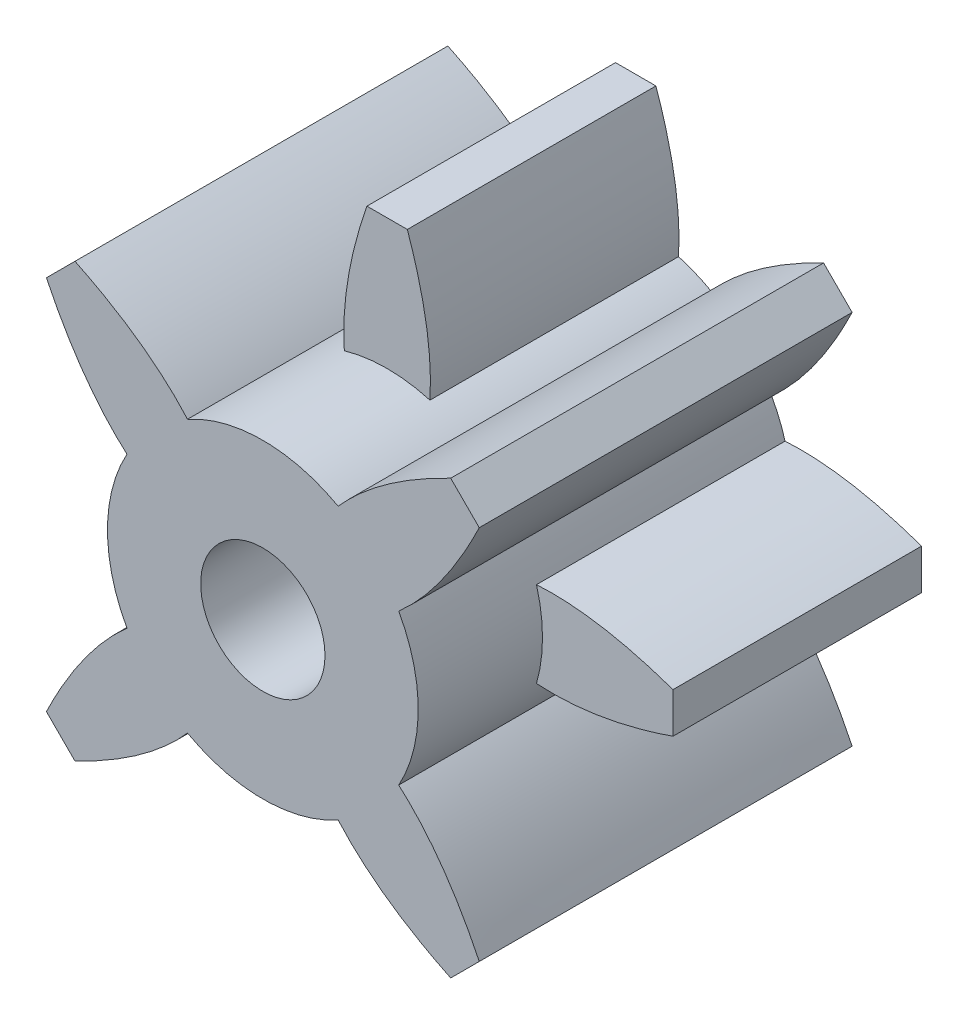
ISO-10303-21;
HEADER;
FILE_DESCRIPTION(('STEP AP214'),'2;1');
FILE_NAME('part.step','',(''),(''),'','','');
FILE_SCHEMA(('AUTOMOTIVE_DESIGN { 1 0 10303 214 1 1 1 1 }'));
ENDSEC;
DATA;
#1=APPLICATION_CONTEXT('core data for automotive mechanical design processes');
#2=APPLICATION_PROTOCOL_DEFINITION('international standard','automotive_design',2000,#1);
#3=PRODUCT_CONTEXT('',#1,'mechanical');
#4=PRODUCT('Part','Part','',(#3));
#5=PRODUCT_RELATED_PRODUCT_CATEGORY('part','',(#4));
#6=PRODUCT_DEFINITION_FORMATION('','',#4);
#7=PRODUCT_DEFINITION_CONTEXT('part definition',#1,'design');
#8=PRODUCT_DEFINITION('design','',#6,#7);
#9=PRODUCT_DEFINITION_SHAPE('','',#8);
#10=(LENGTH_UNIT() NAMED_UNIT(*) SI_UNIT(.MILLI.,.METRE.));
#11=(NAMED_UNIT(*) PLANE_ANGLE_UNIT() SI_UNIT($,.RADIAN.));
#12=(NAMED_UNIT(*) SI_UNIT($,.STERADIAN.) SOLID_ANGLE_UNIT());
#13=UNCERTAINTY_MEASURE_WITH_UNIT(LENGTH_MEASURE(1.E-05),#10,'distance_accuracy_value','');
#14=(GEOMETRIC_REPRESENTATION_CONTEXT(3) GLOBAL_UNCERTAINTY_ASSIGNED_CONTEXT((#13)) GLOBAL_UNIT_ASSIGNED_CONTEXT((#10,
#11,#12)) REPRESENTATION_CONTEXT('',''));
#15=CARTESIAN_POINT('',(0.,0.,0.));
#16=DIRECTION('',(0.,0.,1.));
#17=DIRECTION('',(1.,0.,0.));
#18=AXIS2_PLACEMENT_3D('',#15,#16,#17);
#19=CARTESIAN_POINT('',(0.,63.,-65.3553390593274));
#20=DIRECTION('',(0.,0.,1.));
#21=DIRECTION('',(1.,0.,0.));
#22=AXIS2_PLACEMENT_3D('',#19,#20,#21);
#23=CYLINDRICAL_SURFACE('',#22,12.5);
#24=DIRECTION('',(0.,0.,1.));
#25=VECTOR('',#24,1.);
#26=CARTESIAN_POINT('',(12.0157712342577,66.4454669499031,-30.));
#27=LINE('',#26,#25);
#28=CARTESIAN_POINT('',(12.0157712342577,66.4454669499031,-30.));
#29=VERTEX_POINT('',#28);
#30=CARTESIAN_POINT('',(12.0157712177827,66.4454669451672,-10.));
#31=VERTEX_POINT('',#30);
#32=EDGE_CURVE('E983',#29,#31,#27,.T.);
#33=ORIENTED_EDGE('',*,*,#32,.F.);
#34=CARTESIAN_POINT('',(0.,63.,-30.));
#35=DIRECTION('',(0.,0.,1.));
#36=DIRECTION('',(1.,0.,0.));
#37=AXIS2_PLACEMENT_3D('',#34,#35,#36);
#38=CIRCLE('',#37,12.5);
#39=CARTESIAN_POINT('',(10.9327463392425,69.0601202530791,-30.));
#40=VERTEX_POINT('',#39);
#41=EDGE_CURVE('E380',#40,#29,#38,.F.);
#42=ORIENTED_EDGE('',*,*,#41,.F.);
#43=DIRECTION('',(0.,0.,1.));
#44=VECTOR('',#43,1.);
#45=CARTESIAN_POINT('',(10.9327463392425,69.0601202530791,-30.));
#46=LINE('',#45,#44);
#47=CARTESIAN_POINT('',(10.9327463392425,69.0601202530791,0.));
#48=VERTEX_POINT('',#47);
#49=EDGE_CURVE('E546',#40,#48,#46,.T.);
#50=ORIENTED_EDGE('',*,*,#49,.T.);
#51=CARTESIAN_POINT('',(0.,63.,0.));
#52=DIRECTION('',(0.,0.,1.));
#53=DIRECTION('',(1.,0.,0.));
#54=AXIS2_PLACEMENT_3D('',#51,#52,#53);
#55=CIRCLE('',#54,12.5);
#56=CARTESIAN_POINT('',(10.9327463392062,56.9398797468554,0.));
#57=VERTEX_POINT('',#56);
#58=EDGE_CURVE('E366',#57,#48,#55,.T.);
#59=ORIENTED_EDGE('',*,*,#58,.F.);
#60=DIRECTION('',(0.,0.,1.));
#61=VECTOR('',#60,1.);
#62=CARTESIAN_POINT('',(10.9327463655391,56.9398797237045,-30.));
#63=LINE('',#62,#61);
#64=CARTESIAN_POINT('',(10.9327463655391,56.9398797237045,-30.));
#65=VERTEX_POINT('',#64);
#66=EDGE_CURVE('E1034',#65,#57,#63,.T.);
#67=ORIENTED_EDGE('',*,*,#66,.F.);
#68=CARTESIAN_POINT('',(12.0157711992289,59.5545330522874,-30.));
#69=VERTEX_POINT('',#68);
#70=EDGE_CURVE('E375',#69,#65,#38,.F.);
#71=ORIENTED_EDGE('',*,*,#70,.F.);
#72=DIRECTION('',(0.,0.,1.));
#73=VECTOR('',#72,1.);
#74=CARTESIAN_POINT('',(12.0157711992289,59.5545330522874,-30.));
#75=LINE('',#74,#73);
#76=CARTESIAN_POINT('',(12.0157712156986,59.5545330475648,-10.));
#77=VERTEX_POINT('',#76);
#78=EDGE_CURVE('E550',#69,#77,#75,.T.);
#79=ORIENTED_EDGE('',*,*,#78,.T.);
#80=CARTESIAN_POINT('',(0.,63.,-10.));
#81=DIRECTION('',(0.,0.,-1.));
#82=DIRECTION('',(1.,0.,0.));
#83=AXIS2_PLACEMENT_3D('',#80,#81,#82);
#84=CIRCLE('',#83,12.5000000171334);
#85=EDGE_CURVE('E254',#31,#77,#84,.T.);
#86=ORIENTED_EDGE('',*,*,#85,.F.);
#87=EDGE_LOOP('',(#33,#42,#50,#59,#67,#71,#79,#86));
#88=FACE_BOUND('',#87,.T.);
#89=ADVANCED_FACE('F33',(#88),#23,.T.);
#90=DIRECTION('',(0.,0.,1.));
#91=VECTOR('',#90,1.);
#92=CARTESIAN_POINT('',(-3.44546694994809,75.0157712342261,-30.));
#93=LINE('',#92,#91);
#94=CARTESIAN_POINT('',(-3.44546694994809,75.0157712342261,-30.));
#95=VERTEX_POINT('',#94);
#96=CARTESIAN_POINT('',(-3.44546694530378,75.0157712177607,-10.));
#97=VERTEX_POINT('',#96);
#98=EDGE_CURVE('E408',#95,#97,#93,.T.);
#99=ORIENTED_EDGE('',*,*,#98,.F.);
#100=CARTESIAN_POINT('',(-6.06012025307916,73.9327463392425,-30.));
#101=VERTEX_POINT('',#100);
#102=EDGE_CURVE('E352',#101,#95,#38,.F.);
#103=ORIENTED_EDGE('',*,*,#102,.F.);
#104=DIRECTION('',(0.,0.,1.));
#105=VECTOR('',#104,1.);
#106=CARTESIAN_POINT('',(-6.06012025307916,73.9327463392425,-30.));
#107=LINE('',#106,#105);
#108=CARTESIAN_POINT('',(-6.06012025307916,73.9327463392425,0.));
#109=VERTEX_POINT('',#108);
#110=EDGE_CURVE('E405',#101,#109,#107,.T.);
#111=ORIENTED_EDGE('',*,*,#110,.T.);
#112=CARTESIAN_POINT('',(6.06012025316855,73.9327463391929,0.));
#113=VERTEX_POINT('',#112);
#114=EDGE_CURVE('E528',#113,#109,#55,.T.);
#115=ORIENTED_EDGE('',*,*,#114,.F.);
#116=DIRECTION('',(0.,0.,1.));
#117=VECTOR('',#116,1.);
#118=CARTESIAN_POINT('',(6.0601202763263,73.9327463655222,-30.));
#119=LINE('',#118,#117);
#120=CARTESIAN_POINT('',(6.0601202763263,73.9327463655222,-30.));
#121=VERTEX_POINT('',#120);
#122=EDGE_CURVE('E553',#121,#113,#119,.T.);
#123=ORIENTED_EDGE('',*,*,#122,.F.);
#124=CARTESIAN_POINT('',(3.44546694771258,75.015771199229,-30.));
#125=VERTEX_POINT('',#124);
#126=EDGE_CURVE('E385',#125,#121,#38,.F.);
#127=ORIENTED_EDGE('',*,*,#126,.F.);
#128=DIRECTION('',(0.,0.,1.));
#129=VECTOR('',#128,1.);
#130=CARTESIAN_POINT('',(3.44546694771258,75.015771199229,-30.));
#131=LINE('',#130,#129);
#132=CARTESIAN_POINT('',(3.44546695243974,75.0157712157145,-10.));
#133=VERTEX_POINT('',#132);
#134=EDGE_CURVE('E413',#125,#133,#131,.T.);
#135=ORIENTED_EDGE('',*,*,#134,.T.);
#136=CARTESIAN_POINT('',(0.,63.,-10.));
#137=DIRECTION('',(0.,0.,-1.));
#138=DIRECTION('',(1.,0.,0.));
#139=AXIS2_PLACEMENT_3D('',#136,#137,#138);
#140=CIRCLE('',#139,12.5000000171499);
#141=EDGE_CURVE('E410',#97,#133,#140,.T.);
#142=ORIENTED_EDGE('',*,*,#141,.F.);
#143=EDGE_LOOP('',(#99,#103,#111,#115,#123,#127,#135,#142));
#144=FACE_BOUND('',#143,.T.);
#145=ADVANCED_FACE('F295',(#144),#23,.T.);
#146=DIRECTION('',(0.,0.,1.));
#147=VECTOR('',#146,1.);
#148=CARTESIAN_POINT('',(-12.0157712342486,59.5545330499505,-30.));
#149=LINE('',#148,#147);
#150=CARTESIAN_POINT('',(-12.0157712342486,59.5545330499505,-30.));
#151=VERTEX_POINT('',#150);
#152=CARTESIAN_POINT('',(-12.0157712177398,59.5545330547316,-10.));
#153=VERTEX_POINT('',#152);
#154=EDGE_CURVE('E326',#151,#153,#149,.T.);
#155=ORIENTED_EDGE('',*,*,#154,.F.);
#156=CARTESIAN_POINT('',(-10.9327463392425,56.9398797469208,-30.));
#157=VERTEX_POINT('',#156);
#158=EDGE_CURVE('E329',#157,#151,#38,.F.);
#159=ORIENTED_EDGE('',*,*,#158,.F.);
#160=DIRECTION('',(0.,0.,1.));
#161=VECTOR('',#160,1.);
#162=CARTESIAN_POINT('',(-10.9327463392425,56.9398797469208,-30.));
#163=LINE('',#162,#161);
#164=CARTESIAN_POINT('',(-10.9327463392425,56.9398797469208,0.));
#165=VERTEX_POINT('',#164);
#166=EDGE_CURVE('E361',#157,#165,#163,.T.);
#167=ORIENTED_EDGE('',*,*,#166,.T.);
#168=CARTESIAN_POINT('',(-10.9327463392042,69.0601202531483,0.));
#169=VERTEX_POINT('',#168);
#170=EDGE_CURVE('E360',#169,#165,#55,.T.);
#171=ORIENTED_EDGE('',*,*,#170,.F.);
#172=DIRECTION('',(0.,0.,1.));
#173=VECTOR('',#172,1.);
#174=CARTESIAN_POINT('',(-10.9327463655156,69.0601202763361,-30.));
#175=LINE('',#174,#173);
#176=CARTESIAN_POINT('',(-10.9327463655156,69.0601202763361,-30.));
#177=VERTEX_POINT('',#176);
#178=EDGE_CURVE('E611',#177,#169,#175,.T.);
#179=ORIENTED_EDGE('',*,*,#178,.F.);
#180=CARTESIAN_POINT('',(-12.015771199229,66.4454669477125,-30.));
#181=VERTEX_POINT('',#180);
#182=EDGE_CURVE('E347',#181,#177,#38,.F.);
#183=ORIENTED_EDGE('',*,*,#182,.F.);
#184=DIRECTION('',(0.,0.,1.));
#185=VECTOR('',#184,1.);
#186=CARTESIAN_POINT('',(-12.015771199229,66.4454669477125,-30.));
#187=LINE('',#186,#185);
#188=CARTESIAN_POINT('',(-12.0157712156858,66.4454669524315,-10.));
#189=VERTEX_POINT('',#188);
#190=EDGE_CURVE('E334',#181,#189,#187,.T.);
#191=ORIENTED_EDGE('',*,*,#190,.T.);
#192=CARTESIAN_POINT('',(0.,63.,-10.));
#193=DIRECTION('',(0.,0.,-1.));
#194=DIRECTION('',(1.,0.,0.));
#195=AXIS2_PLACEMENT_3D('',#192,#193,#194);
#196=CIRCLE('',#195,12.50000001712);
#197=EDGE_CURVE('E331',#153,#189,#196,.T.);
#198=ORIENTED_EDGE('',*,*,#197,.F.);
#199=EDGE_LOOP('',(#155,#159,#167,#171,#179,#183,#191,#198));
#200=FACE_BOUND('',#199,.T.);
#201=ADVANCED_FACE('F302',(#200),#23,.T.);
#202=CARTESIAN_POINT('',(730080.784290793,683431.539728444,-30.));
#203=CARTESIAN_POINT('',(-734869.157469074,-678174.753289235,-30.));
#204=CARTESIAN_POINT('',(739674.825999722,673035.840905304,-30.));
#205=B_SPLINE_CURVE_WITH_KNOTS('',2,(#202,#203,#204),.UNSPECIFIED.,.F.,.F.,(3,3),(0.,1.),.UNSPECIFIED.);
#206=DIRECTION('',(0.,0.,1.));
#207=VECTOR('',#206,1.);
#208=SURFACE_OF_LINEAR_EXTRUSION('',#205,#207);
#209=CARTESIAN_POINT('',(730080.784290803,683431.539728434,-10.));
#210=CARTESIAN_POINT('',(-734869.157469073,-678174.753289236,-10.));
#211=CARTESIAN_POINT('',(739674.825999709,673035.840905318,-10.));
#212=B_SPLINE_CURVE_WITH_KNOTS('',2,(#209,#210,#211),.UNSPECIFIED.,.F.,.F.,(3,3),(0.,1.),.UNSPECIFIED.);
#213=CARTESIAN_POINT('',(-3.44546695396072,50.9842287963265,-10.));
#214=VERTEX_POINT('',#213);
#215=CARTESIAN_POINT('',(-1.62499999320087,39.9999999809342,-10.));
#216=VERTEX_POINT('',#215);
#217=EDGE_CURVE('E244',#214,#216,#212,.T.);
#218=ORIENTED_EDGE('',*,*,#217,.F.);
#219=DIRECTION('',(0.,0.,1.));
#220=VECTOR('',#219,1.);
#221=CARTESIAN_POINT('',(-3.44546694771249,50.984228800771,-30.));
#222=LINE('',#221,#220);
#223=CARTESIAN_POINT('',(-3.44546694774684,50.9842288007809,-30.));
#224=VERTEX_POINT('',#223);
#225=EDGE_CURVE('E11',#224,#214,#222,.T.);
#226=ORIENTED_EDGE('',*,*,#225,.F.);
#227=CARTESIAN_POINT('',(-1.625,40.,-30.));
#228=VERTEX_POINT('',#227);
#229=EDGE_CURVE('E266',#224,#228,#205,.T.);
#230=ORIENTED_EDGE('',*,*,#229,.T.);
#231=DIRECTION('',(0.,0.,1.));
#232=VECTOR('',#231,1.);
#233=CARTESIAN_POINT('',(-1.625,40.,-30.));
#234=LINE('',#233,#232);
#235=EDGE_CURVE('E38',#228,#216,#234,.T.);
#236=ORIENTED_EDGE('',*,*,#235,.T.);
#237=EDGE_LOOP('',(#218,#226,#230,#236));
#238=FACE_BOUND('',#237,.T.);
#239=ADVANCED_FACE('F35',(#238),#208,.T.);
#240=CARTESIAN_POINT('',(-739674.825999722,673035.840905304,-30.));
#241=CARTESIAN_POINT('',(734869.157469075,-678174.753289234,-30.));
#242=CARTESIAN_POINT('',(-730080.784290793,683431.539728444,-30.));
#243=B_SPLINE_CURVE_WITH_KNOTS('',2,(#240,#241,#242),.UNSPECIFIED.,.F.,.F.,(3,3),(0.,1.),.UNSPECIFIED.);
#244=DIRECTION('',(0.,0.,1.));
#245=VECTOR('',#244,1.);
#246=SURFACE_OF_LINEAR_EXTRUSION('',#243,#245);
#247=CARTESIAN_POINT('',(-739674.825999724,673035.840905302,-10.));
#248=CARTESIAN_POINT('',(734869.157469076,-678174.753289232,-10.));
#249=CARTESIAN_POINT('',(-730080.784290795,683431.539728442,-10.));
#250=B_SPLINE_CURVE_WITH_KNOTS('',2,(#247,#248,#249),.UNSPECIFIED.,.F.,.F.,(3,3),(0.,1.),.UNSPECIFIED.);
#251=CARTESIAN_POINT('',(1.62499999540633,39.9999999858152,-10.));
#252=VERTEX_POINT('',#251);
#253=CARTESIAN_POINT('',(3.44546694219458,50.9842287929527,-10.));
#254=VERTEX_POINT('',#253);
#255=EDGE_CURVE('E262',#252,#254,#250,.T.);
#256=ORIENTED_EDGE('',*,*,#255,.F.);
#257=DIRECTION('',(0.,0.,1.));
#258=VECTOR('',#257,1.);
#259=CARTESIAN_POINT('',(1.625,40.,-30.));
#260=LINE('',#259,#258);
#261=CARTESIAN_POINT('',(1.625,40.,-30.));
#262=VERTEX_POINT('',#261);
#263=EDGE_CURVE('E261',#262,#252,#260,.T.);
#264=ORIENTED_EDGE('',*,*,#263,.F.);
#265=CARTESIAN_POINT('',(3.44546695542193,50.9842288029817,-30.));
#266=VERTEX_POINT('',#265);
#267=EDGE_CURVE('E267',#262,#266,#243,.T.);
#268=ORIENTED_EDGE('',*,*,#267,.T.);
#269=DIRECTION('',(0.,0.,1.));
#270=VECTOR('',#269,1.);
#271=CARTESIAN_POINT('',(3.44546694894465,50.9842288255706,-30.));
#272=LINE('',#271,#270);
#273=EDGE_CURVE('E43',#266,#254,#272,.T.);
#274=ORIENTED_EDGE('',*,*,#273,.T.);
#275=EDGE_LOOP('',(#256,#264,#268,#274));
#276=FACE_BOUND('',#275,.T.);
#277=ADVANCED_FACE('F283',(#276),#246,.T.);
#278=CARTESIAN_POINT('',(-1.625,40.,-30.));
#279=DIRECTION('',(0.,-1.,0.));
#280=DIRECTION('',(0.,0.,-1.));
#281=AXIS2_PLACEMENT_3D('',#278,#279,#280);
#282=PLANE('',#281);
#283=DIRECTION('',(1.,5.86640779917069E-09,0.));
#284=VECTOR('',#283,1.);
#285=CARTESIAN_POINT('',(-1.62499999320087,39.9999999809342,-10.));
#286=LINE('',#285,#284);
#287=EDGE_CURVE('E247',#216,#252,#286,.T.);
#288=ORIENTED_EDGE('',*,*,#287,.F.);
#289=ORIENTED_EDGE('',*,*,#235,.F.);
#290=DIRECTION('',(1.,0.,0.));
#291=VECTOR('',#290,1.);
#292=CARTESIAN_POINT('',(-1.625,40.,-30.));
#293=LINE('',#292,#291);
#294=EDGE_CURVE('E269',#228,#262,#293,.T.);
#295=ORIENTED_EDGE('',*,*,#294,.T.);
#296=ORIENTED_EDGE('',*,*,#263,.T.);
#297=EDGE_LOOP('',(#288,#289,#295,#296));
#298=FACE_BOUND('',#297,.T.);
#299=ADVANCED_FACE('F258',(#298),#282,.T.);
#300=CARTESIAN_POINT('',(4.32383809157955,29.4685138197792,-30.));
#301=DIRECTION('',(0.,0.,1.));
#302=DIRECTION('',(1.,0.,0.));
#303=AXIS2_PLACEMENT_3D('',#300,#301,#302);
#304=PLANE('',#303);
#305=ORIENTED_EDGE('',*,*,#229,.F.);
#306=CARTESIAN_POINT('',(-6.06012027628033,52.0672536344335,-30.));
#307=VERTEX_POINT('',#306);
#308=EDGE_CURVE('E346',#224,#307,#38,.F.);
#309=ORIENTED_EDGE('',*,*,#308,.T.);
#310=CARTESIAN_POINT('',(-950180.537436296,311814.088324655,-30.));
#311=CARTESIAN_POINT('',(948444.055190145,-316878.588545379,-30.));
#312=CARTESIAN_POINT('',(-946718.77705994,322173.572810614,-30.));
#313=B_SPLINE_CURVE_WITH_KNOTS('',2,(#310,#311,#312),.UNSPECIFIED.,.F.,.F.,(3,3),(0.,1.),.UNSPECIFIED.);
#314=CARTESIAN_POINT('',(-15.1144074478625,45.5874955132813,-30.));
#315=VERTEX_POINT('',#314);
#316=EDGE_CURVE('E489',#315,#307,#313,.T.);
#317=ORIENTED_EDGE('',*,*,#316,.F.);
#318=DIRECTION('',(0.707106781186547,-0.707106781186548,0.));
#319=VECTOR('',#318,1.);
#320=CARTESIAN_POINT('',(-17.4125044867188,47.8855925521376,-30.));
#321=LINE('',#320,#319);
#322=CARTESIAN_POINT('',(-17.4125044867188,47.8855925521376,-30.));
#323=VERTEX_POINT('',#322);
#324=EDGE_CURVE('E472',#323,#315,#321,.T.);
#325=ORIENTED_EDGE('',*,*,#324,.F.);
#326=CARTESIAN_POINT('',(322110.572810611,-946655.777059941,-30.));
#327=CARTESIAN_POINT('',(-316941.588545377,948507.055190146,-30.));
#328=CARTESIAN_POINT('',(311751.088324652,-950117.537436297,-30.));
#329=B_SPLINE_CURVE_WITH_KNOTS('',2,(#326,#327,#328),.UNSPECIFIED.,.F.,.F.,(3,3),(0.,1.),.UNSPECIFIED.);
#330=EDGE_CURVE('E345',#157,#323,#329,.T.);
#331=ORIENTED_EDGE('',*,*,#330,.F.);
#332=ORIENTED_EDGE('',*,*,#158,.T.);
#333=CARTESIAN_POINT('',(-451437.792776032,892383.409969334,-30.));
#334=CARTESIAN_POINT('',(446539.676500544,-894699.769501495,-30.));
#335=CARTESIAN_POINT('',(-441664.696809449,897260.837461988,-30.));
#336=B_SPLINE_CURVE_WITH_KNOTS('',2,(#333,#334,#335),.UNSPECIFIED.,.F.,.F.,(3,3),(0.,1.),.UNSPECIFIED.);
#337=CARTESIAN_POINT('',(-23.,61.3750000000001,-30.));
#338=VERTEX_POINT('',#337);
#339=EDGE_CURVE('E341',#338,#151,#336,.T.);
#340=ORIENTED_EDGE('',*,*,#339,.F.);
#341=DIRECTION('',(0.,-1.,0.));
#342=VECTOR('',#341,1.);
#343=CARTESIAN_POINT('',(-23.,64.6250000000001,-30.));
#344=LINE('',#343,#342);
#345=CARTESIAN_POINT('',(-23.,64.6250000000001,-30.));
#346=VERTEX_POINT('',#345);
#347=EDGE_CURVE('E457',#346,#338,#344,.T.);
#348=ORIENTED_EDGE('',*,*,#347,.F.);
#349=CARTESIAN_POINT('',(-441664.696809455,-897134.837461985,-30.));
#350=CARTESIAN_POINT('',(446539.67650055,894825.769501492,-30.));
#351=CARTESIAN_POINT('',(-451437.792776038,-892257.409969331,-30.));
#352=B_SPLINE_CURVE_WITH_KNOTS('',2,(#349,#350,#351),.UNSPECIFIED.,.F.,.F.,(3,3),(0.,1.),.UNSPECIFIED.);
#353=EDGE_CURVE('E610',#181,#346,#352,.T.);
#354=ORIENTED_EDGE('',*,*,#353,.F.);
#355=ORIENTED_EDGE('',*,*,#182,.T.);
#356=CARTESIAN_POINT('',(311751.088324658,950243.537436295,-30.));
#357=CARTESIAN_POINT('',(-316941.588545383,-948381.055190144,-30.));
#358=CARTESIAN_POINT('',(322110.572810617,946781.777059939,-30.));
#359=B_SPLINE_CURVE_WITH_KNOTS('',2,(#356,#357,#358),.UNSPECIFIED.,.F.,.F.,(3,3),(0.,1.),.UNSPECIFIED.);
#360=CARTESIAN_POINT('',(-17.4125044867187,78.1144074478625,-30.));
#361=VERTEX_POINT('',#360);
#362=EDGE_CURVE('E586',#361,#177,#359,.T.);
#363=ORIENTED_EDGE('',*,*,#362,.F.);
#364=DIRECTION('',(-0.707106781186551,-0.707106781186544,0.));
#365=VECTOR('',#364,1.);
#366=CARTESIAN_POINT('',(-15.1144074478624,80.4125044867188,-30.));
#367=LINE('',#366,#365);
#368=CARTESIAN_POINT('',(-15.1144074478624,80.4125044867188,-30.));
#369=VERTEX_POINT('',#368);
#370=EDGE_CURVE('E429',#369,#361,#367,.T.);
#371=ORIENTED_EDGE('',*,*,#370,.F.);
#372=CARTESIAN_POINT('',(-946718.777059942,-322047.572810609,-30.));
#373=CARTESIAN_POINT('',(948444.055190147,317004.588545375,-30.));
#374=CARTESIAN_POINT('',(-950180.537436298,-311688.08832465,-30.));
#375=B_SPLINE_CURVE_WITH_KNOTS('',2,(#372,#373,#374),.UNSPECIFIED.,.F.,.F.,(3,3),(0.,1.),.UNSPECIFIED.);
#376=EDGE_CURVE('E402',#101,#369,#375,.T.);
#377=ORIENTED_EDGE('',*,*,#376,.F.);
#378=ORIENTED_EDGE('',*,*,#102,.T.);
#379=CARTESIAN_POINT('',(892320.409969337,451500.792776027,-30.));
#380=CARTESIAN_POINT('',(-894762.769501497,-446476.676500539,-30.));
#381=CARTESIAN_POINT('',(897197.83746199,441727.696809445,-30.));
#382=B_SPLINE_CURVE_WITH_KNOTS('',2,(#379,#380,#381),.UNSPECIFIED.,.F.,.F.,(3,3),(0.,1.),.UNSPECIFIED.);
#383=CARTESIAN_POINT('',(-1.62499999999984,86.,-30.));
#384=VERTEX_POINT('',#383);
#385=EDGE_CURVE('E398',#384,#95,#382,.T.);
#386=ORIENTED_EDGE('',*,*,#385,.F.);
#387=DIRECTION('',(-1.,0.,0.));
#388=VECTOR('',#387,1.);
#389=CARTESIAN_POINT('',(1.62500000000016,86.,-30.));
#390=LINE('',#389,#388);
#391=CARTESIAN_POINT('',(1.62500000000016,86.,-30.));
#392=VERTEX_POINT('',#391);
#393=EDGE_CURVE('E556',#392,#384,#390,.T.);
#394=ORIENTED_EDGE('',*,*,#393,.F.);
#395=CARTESIAN_POINT('',(-897197.837461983,441727.696809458,-30.));
#396=CARTESIAN_POINT('',(894762.769501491,-446476.676500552,-30.));
#397=CARTESIAN_POINT('',(-892320.40996933,451500.79277604,-30.));
#398=B_SPLINE_CURVE_WITH_KNOTS('',2,(#395,#396,#397),.UNSPECIFIED.,.F.,.F.,(3,3),(0.,1.),.UNSPECIFIED.);
#399=EDGE_CURVE('E552',#125,#392,#398,.T.);
#400=ORIENTED_EDGE('',*,*,#399,.F.);
#401=ORIENTED_EDGE('',*,*,#126,.T.);
#402=CARTESIAN_POINT('',(950180.537436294,-311688.088324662,-30.));
#403=CARTESIAN_POINT('',(-948444.055190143,317004.588545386,-30.));
#404=CARTESIAN_POINT('',(946718.777059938,-322047.57281062,-30.));
#405=B_SPLINE_CURVE_WITH_KNOTS('',2,(#402,#403,#404),.UNSPECIFIED.,.F.,.F.,(3,3),(0.,1.),.UNSPECIFIED.);
#406=CARTESIAN_POINT('',(15.1144074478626,80.4125044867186,-30.));
#407=VERTEX_POINT('',#406);
#408=EDGE_CURVE('E568',#407,#121,#405,.T.);
#409=ORIENTED_EDGE('',*,*,#408,.F.);
#410=DIRECTION('',(-0.707106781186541,0.707106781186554,0.));
#411=VECTOR('',#410,1.);
#412=CARTESIAN_POINT('',(17.4125044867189,78.1144074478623,-30.));
#413=LINE('',#412,#411);
#414=CARTESIAN_POINT('',(17.4125044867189,78.1144074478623,-30.));
#415=VERTEX_POINT('',#414);
#416=EDGE_CURVE('E996',#415,#407,#413,.T.);
#417=ORIENTED_EDGE('',*,*,#416,.F.);
#418=CARTESIAN_POINT('',(-322110.572810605,946781.777059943,-30.));
#419=CARTESIAN_POINT('',(316941.58854537,-948381.055190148,-30.));
#420=CARTESIAN_POINT('',(-311751.088324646,950243.537436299,-30.));
#421=B_SPLINE_CURVE_WITH_KNOTS('',2,(#418,#419,#420),.UNSPECIFIED.,.F.,.F.,(3,3),(0.,1.),.UNSPECIFIED.);
#422=EDGE_CURVE('E991',#40,#415,#421,.T.);
#423=ORIENTED_EDGE('',*,*,#422,.F.);
#424=ORIENTED_EDGE('',*,*,#41,.T.);
#425=CARTESIAN_POINT('',(451437.792776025,-892257.409969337,-30.));
#426=CARTESIAN_POINT('',(-446539.676500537,894825.769501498,-30.));
#427=CARTESIAN_POINT('',(441664.696809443,-897134.837461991,-30.));
#428=B_SPLINE_CURVE_WITH_KNOTS('',2,(#425,#426,#427),.UNSPECIFIED.,.F.,.F.,(3,3),(0.,1.),.UNSPECIFIED.);
#429=CARTESIAN_POINT('',(23.,64.6249999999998,-30.));
#430=VERTEX_POINT('',#429);
#431=EDGE_CURVE('E969',#430,#29,#428,.T.);
#432=ORIENTED_EDGE('',*,*,#431,.F.);
#433=DIRECTION('',(0.,1.,0.));
#434=VECTOR('',#433,1.);
#435=CARTESIAN_POINT('',(23.,61.3749999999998,-30.));
#436=LINE('',#435,#434);
#437=CARTESIAN_POINT('',(23.,61.3749999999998,-30.));
#438=VERTEX_POINT('',#437);
#439=EDGE_CURVE('E976',#438,#430,#436,.T.);
#440=ORIENTED_EDGE('',*,*,#439,.F.);
#441=CARTESIAN_POINT('',(441664.696809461,897260.837461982,-30.));
#442=CARTESIAN_POINT('',(-446539.676500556,-894699.769501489,-30.));
#443=CARTESIAN_POINT('',(451437.792776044,892383.409969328,-30.));
#444=B_SPLINE_CURVE_WITH_KNOTS('',2,(#441,#442,#443),.UNSPECIFIED.,.F.,.F.,(3,3),(0.,1.),.UNSPECIFIED.);
#445=EDGE_CURVE('E1019',#69,#438,#444,.T.);
#446=ORIENTED_EDGE('',*,*,#445,.F.);
#447=ORIENTED_EDGE('',*,*,#70,.T.);
#448=CARTESIAN_POINT('',(-311751.088324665,-950117.537436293,-30.));
#449=CARTESIAN_POINT('',(316941.588545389,948507.055190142,-30.));
#450=CARTESIAN_POINT('',(-322110.572810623,-946655.777059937,-30.));
#451=B_SPLINE_CURVE_WITH_KNOTS('',2,(#448,#449,#450),.UNSPECIFIED.,.F.,.F.,(3,3),(0.,1.),.UNSPECIFIED.);
#452=CARTESIAN_POINT('',(17.4125044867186,47.8855925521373,-30.));
#453=VERTEX_POINT('',#452);
#454=EDGE_CURVE('E1032',#453,#65,#451,.T.);
#455=ORIENTED_EDGE('',*,*,#454,.F.);
#456=DIRECTION('',(0.707106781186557,0.707106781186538,0.));
#457=VECTOR('',#456,1.);
#458=CARTESIAN_POINT('',(15.1144074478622,45.5874955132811,-30.));
#459=LINE('',#458,#457);
#460=CARTESIAN_POINT('',(15.1144074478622,45.5874955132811,-30.));
#461=VERTEX_POINT('',#460);
#462=EDGE_CURVE('E963',#461,#453,#459,.T.);
#463=ORIENTED_EDGE('',*,*,#462,.F.);
#464=CARTESIAN_POINT('',(946718.777059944,322173.572810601,-30.));
#465=CARTESIAN_POINT('',(-948444.055190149,-316878.588545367,-30.));
#466=CARTESIAN_POINT('',(950180.5374363,311814.088324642,-30.));
#467=B_SPLINE_CURVE_WITH_KNOTS('',2,(#464,#465,#466),.UNSPECIFIED.,.F.,.F.,(3,3),(0.,1.),.UNSPECIFIED.);
#468=CARTESIAN_POINT('',(6.06012025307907,52.0672536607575,-30.));
#469=VERTEX_POINT('',#468);
#470=EDGE_CURVE('E957',#469,#461,#467,.T.);
#471=ORIENTED_EDGE('',*,*,#470,.F.);
#472=EDGE_CURVE('E350',#469,#266,#38,.F.);
#473=ORIENTED_EDGE('',*,*,#472,.T.);
#474=ORIENTED_EDGE('',*,*,#267,.F.);
#475=ORIENTED_EDGE('',*,*,#294,.F.);
#476=EDGE_LOOP('',(#305,#309,#317,#325,#331,#332,#340,#348,#354,#355,#363,#371,#377,#378,#386,
#394,#400,#401,#409,#417,#423,#424,#432,#440,#446,#447,#455,#463,#471,#473,#474,#475));
#477=FACE_BOUND('',#476,.T.);
#478=CARTESIAN_POINT('',(0.,63.,-30.));
#479=DIRECTION('',(0.,0.,1.));
#480=DIRECTION('',(1.,0.,0.));
#481=AXIS2_PLACEMENT_3D('',#478,#479,#480);
#482=CIRCLE('',#481,5.);
#483=CARTESIAN_POINT('',(5.,63.,-30.));
#484=VERTEX_POINT('',#483);
#485=EDGE_CURVE('E365',#484,#484,#482,.F.);
#486=ORIENTED_EDGE('',*,*,#485,.F.);
#487=EDGE_LOOP('',(#486));
#488=FACE_BOUND('',#487,.T.);
#489=ADVANCED_FACE('F289',(#477,#488),#304,.F.);
#490=CARTESIAN_POINT('',(4.32383809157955,29.4685138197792,0.));
#491=DIRECTION('',(0.,0.,1.));
#492=DIRECTION('',(1.,0.,0.));
#493=AXIS2_PLACEMENT_3D('',#490,#491,#492);
#494=PLANE('',#493);
#495=CARTESIAN_POINT('',(-950180.537436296,311814.088324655,0.));
#496=CARTESIAN_POINT('',(948444.055190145,-316878.588545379,0.));
#497=CARTESIAN_POINT('',(-946718.77705994,322173.572810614,0.));
#498=B_SPLINE_CURVE_WITH_KNOTS('',2,(#495,#496,#497),.UNSPECIFIED.,.F.,.F.,(3,3),(0.,1.),.UNSPECIFIED.);
#499=CARTESIAN_POINT('',(-15.1144074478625,45.5874955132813,0.));
#500=VERTEX_POINT('',#499);
#501=CARTESIAN_POINT('',(-6.06012025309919,52.0672536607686,0.));
#502=VERTEX_POINT('',#501);
#503=EDGE_CURVE('E473',#500,#502,#498,.T.);
#504=ORIENTED_EDGE('',*,*,#503,.T.);
#505=CARTESIAN_POINT('',(6.06012025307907,52.0672536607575,0.));
#506=VERTEX_POINT('',#505);
#507=EDGE_CURVE('E362',#502,#506,#55,.T.);
#508=ORIENTED_EDGE('',*,*,#507,.T.);
#509=CARTESIAN_POINT('',(946718.777059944,322173.572810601,0.));
#510=CARTESIAN_POINT('',(-948444.055190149,-316878.588545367,0.));
#511=CARTESIAN_POINT('',(950180.5374363,311814.088324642,0.));
#512=B_SPLINE_CURVE_WITH_KNOTS('',2,(#509,#510,#511),.UNSPECIFIED.,.F.,.F.,(3,3),(0.,1.),.UNSPECIFIED.);
#513=CARTESIAN_POINT('',(15.1144074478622,45.5874955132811,0.));
#514=VERTEX_POINT('',#513);
#515=EDGE_CURVE('E1046',#506,#514,#512,.T.);
#516=ORIENTED_EDGE('',*,*,#515,.T.);
#517=DIRECTION('',(0.707106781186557,0.707106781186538,0.));
#518=VECTOR('',#517,1.);
#519=CARTESIAN_POINT('',(15.1144074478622,45.5874955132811,0.));
#520=LINE('',#519,#518);
#521=CARTESIAN_POINT('',(17.4125044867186,47.8855925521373,0.));
#522=VERTEX_POINT('',#521);
#523=EDGE_CURVE('E1041',#514,#522,#520,.T.);
#524=ORIENTED_EDGE('',*,*,#523,.T.);
#525=CARTESIAN_POINT('',(-311751.088324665,-950117.537436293,0.));
#526=CARTESIAN_POINT('',(316941.588545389,948507.055190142,0.));
#527=CARTESIAN_POINT('',(-322110.572810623,-946655.777059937,0.));
#528=B_SPLINE_CURVE_WITH_KNOTS('',2,(#525,#526,#527),.UNSPECIFIED.,.F.,.F.,(3,3),(0.,1.),.UNSPECIFIED.);
#529=EDGE_CURVE('E539',#522,#57,#528,.T.);
#530=ORIENTED_EDGE('',*,*,#529,.T.);
#531=ORIENTED_EDGE('',*,*,#58,.T.);
#532=CARTESIAN_POINT('',(-322110.572810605,946781.777059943,0.));
#533=CARTESIAN_POINT('',(316941.58854537,-948381.055190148,0.));
#534=CARTESIAN_POINT('',(-311751.088324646,950243.537436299,0.));
#535=B_SPLINE_CURVE_WITH_KNOTS('',2,(#532,#533,#534),.UNSPECIFIED.,.F.,.F.,(3,3),(0.,1.),.UNSPECIFIED.);
#536=CARTESIAN_POINT('',(17.4125044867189,78.1144074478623,0.));
#537=VERTEX_POINT('',#536);
#538=EDGE_CURVE('E536',#48,#537,#535,.T.);
#539=ORIENTED_EDGE('',*,*,#538,.T.);
#540=DIRECTION('',(-0.707106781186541,0.707106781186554,0.));
#541=VECTOR('',#540,1.);
#542=CARTESIAN_POINT('',(17.4125044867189,78.1144074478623,0.));
#543=LINE('',#542,#541);
#544=CARTESIAN_POINT('',(15.1144074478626,80.4125044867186,0.));
#545=VERTEX_POINT('',#544);
#546=EDGE_CURVE('E549',#537,#545,#543,.T.);
#547=ORIENTED_EDGE('',*,*,#546,.T.);
#548=CARTESIAN_POINT('',(950180.537436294,-311688.088324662,0.));
#549=CARTESIAN_POINT('',(-948444.055190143,317004.588545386,0.));
#550=CARTESIAN_POINT('',(946718.777059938,-322047.57281062,0.));
#551=B_SPLINE_CURVE_WITH_KNOTS('',2,(#548,#549,#550),.UNSPECIFIED.,.F.,.F.,(3,3),(0.,1.),.UNSPECIFIED.);
#552=EDGE_CURVE('E562',#545,#113,#551,.T.);
#553=ORIENTED_EDGE('',*,*,#552,.T.);
#554=ORIENTED_EDGE('',*,*,#114,.T.);
#555=CARTESIAN_POINT('',(-946718.777059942,-322047.572810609,0.));
#556=CARTESIAN_POINT('',(948444.055190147,317004.588545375,0.));
#557=CARTESIAN_POINT('',(-950180.537436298,-311688.08832465,0.));
#558=B_SPLINE_CURVE_WITH_KNOTS('',2,(#555,#556,#557),.UNSPECIFIED.,.F.,.F.,(3,3),(0.,1.),.UNSPECIFIED.);
#559=CARTESIAN_POINT('',(-15.1144074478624,80.4125044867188,0.));
#560=VERTEX_POINT('',#559);
#561=EDGE_CURVE('E416',#109,#560,#558,.T.);
#562=ORIENTED_EDGE('',*,*,#561,.T.);
#563=DIRECTION('',(-0.707106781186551,-0.707106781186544,0.));
#564=VECTOR('',#563,1.);
#565=CARTESIAN_POINT('',(-15.1144074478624,80.4125044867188,0.));
#566=LINE('',#565,#564);
#567=CARTESIAN_POINT('',(-17.4125044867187,78.1144074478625,0.));
#568=VERTEX_POINT('',#567);
#569=EDGE_CURVE('E598',#560,#568,#566,.T.);
#570=ORIENTED_EDGE('',*,*,#569,.T.);
#571=CARTESIAN_POINT('',(311751.088324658,950243.537436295,0.));
#572=CARTESIAN_POINT('',(-316941.588545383,-948381.055190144,0.));
#573=CARTESIAN_POINT('',(322110.572810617,946781.777059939,0.));
#574=B_SPLINE_CURVE_WITH_KNOTS('',2,(#571,#572,#573),.UNSPECIFIED.,.F.,.F.,(3,3),(0.,1.),.UNSPECIFIED.);
#575=EDGE_CURVE('E430',#568,#169,#574,.T.);
#576=ORIENTED_EDGE('',*,*,#575,.T.);
#577=ORIENTED_EDGE('',*,*,#170,.T.);
#578=CARTESIAN_POINT('',(322110.572810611,-946655.777059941,0.));
#579=CARTESIAN_POINT('',(-316941.588545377,948507.055190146,0.));
#580=CARTESIAN_POINT('',(311751.088324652,-950117.537436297,0.));
#581=B_SPLINE_CURVE_WITH_KNOTS('',2,(#578,#579,#580),.UNSPECIFIED.,.F.,.F.,(3,3),(0.,1.),.UNSPECIFIED.);
#582=CARTESIAN_POINT('',(-17.4125044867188,47.8855925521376,0.));
#583=VERTEX_POINT('',#582);
#584=EDGE_CURVE('E462',#165,#583,#581,.T.);
#585=ORIENTED_EDGE('',*,*,#584,.T.);
#586=DIRECTION('',(0.707106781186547,-0.707106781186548,0.));
#587=VECTOR('',#586,1.);
#588=CARTESIAN_POINT('',(-17.4125044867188,47.8855925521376,0.));
#589=LINE('',#588,#587);
#590=EDGE_CURVE('E501',#583,#500,#589,.T.);
#591=ORIENTED_EDGE('',*,*,#590,.T.);
#592=EDGE_LOOP('',(#504,#508,#516,#524,#530,#531,#539,#547,#553,#554,#562,#570,#576,#577,#585,#591));
#593=FACE_BOUND('',#592,.T.);
#594=CARTESIAN_POINT('',(0.,63.,0.));
#595=DIRECTION('',(0.,0.,1.));
#596=DIRECTION('',(1.,0.,0.));
#597=AXIS2_PLACEMENT_3D('',#594,#595,#596);
#598=CIRCLE('',#597,5.);
#599=CARTESIAN_POINT('',(5.,63.,0.));
#600=VERTEX_POINT('',#599);
#601=EDGE_CURVE('E357',#600,#600,#598,.T.);
#602=ORIENTED_EDGE('',*,*,#601,.F.);
#603=EDGE_LOOP('',(#602));
#604=FACE_BOUND('',#603,.T.);
#605=ADVANCED_FACE('F286',(#593,#604),#494,.T.);
#606=DIRECTION('',(0.,0.,1.));
#607=VECTOR('',#606,1.);
#608=CARTESIAN_POINT('',(-6.06012027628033,52.0672536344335,-30.));
#609=LINE('',#608,#607);
#610=EDGE_CURVE('E515',#307,#502,#609,.T.);
#611=ORIENTED_EDGE('',*,*,#610,.F.);
#612=ORIENTED_EDGE('',*,*,#308,.F.);
#613=ORIENTED_EDGE('',*,*,#225,.T.);
#614=CARTESIAN_POINT('',(0.,63.,-10.));
#615=DIRECTION('',(0.,0.,-1.));
#616=DIRECTION('',(1.,0.,0.));
#617=AXIS2_PLACEMENT_3D('',#614,#615,#616);
#618=CIRCLE('',#617,12.5000000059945);
#619=EDGE_CURVE('E250',#254,#214,#618,.T.);
#620=ORIENTED_EDGE('',*,*,#619,.F.);
#621=ORIENTED_EDGE('',*,*,#273,.F.);
#622=ORIENTED_EDGE('',*,*,#472,.F.);
#623=DIRECTION('',(0.,0.,1.));
#624=VECTOR('',#623,1.);
#625=CARTESIAN_POINT('',(6.06012025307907,52.0672536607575,-30.));
#626=LINE('',#625,#624);
#627=EDGE_CURVE('E1025',#469,#506,#626,.T.);
#628=ORIENTED_EDGE('',*,*,#627,.T.);
#629=ORIENTED_EDGE('',*,*,#507,.F.);
#630=EDGE_LOOP('',(#611,#612,#613,#620,#621,#622,#628,#629));
#631=FACE_BOUND('',#630,.T.);
#632=ADVANCED_FACE('F298',(#631),#23,.T.);
#633=CARTESIAN_POINT('',(0.,63.,-65.3553390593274));
#634=DIRECTION('',(0.,0.,1.));
#635=DIRECTION('',(1.,0.,0.));
#636=AXIS2_PLACEMENT_3D('',#633,#634,#635);
#637=CYLINDRICAL_SURFACE('',#636,5.);
#638=ORIENTED_EDGE('',*,*,#485,.T.);
#639=EDGE_LOOP('',(#638));
#640=FACE_BOUND('',#639,.T.);
#641=ORIENTED_EDGE('',*,*,#601,.T.);
#642=EDGE_LOOP('',(#641));
#643=FACE_BOUND('',#642,.T.);
#644=ADVANCED_FACE('F307',(#640,#643),#637,.F.);
#645=DIRECTION('',(0.,0.,1.));
#646=VECTOR('',#645,1.);
#647=SURFACE_OF_LINEAR_EXTRUSION('',#329,#646);
#648=ORIENTED_EDGE('',*,*,#584,.F.);
#649=ORIENTED_EDGE('',*,*,#166,.F.);
#650=ORIENTED_EDGE('',*,*,#330,.T.);
#651=DIRECTION('',(0.,0.,1.));
#652=VECTOR('',#651,1.);
#653=CARTESIAN_POINT('',(-17.4125044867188,47.8855925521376,-30.));
#654=LINE('',#653,#652);
#655=EDGE_CURVE('E355',#323,#583,#654,.T.);
#656=ORIENTED_EDGE('',*,*,#655,.T.);
#657=EDGE_LOOP('',(#648,#649,#650,#656));
#658=FACE_BOUND('',#657,.T.);
#659=ADVANCED_FACE('F313',(#658),#647,.T.);
#660=DIRECTION('',(0.,0.,1.));
#661=VECTOR('',#660,1.);
#662=SURFACE_OF_LINEAR_EXTRUSION('',#313,#661);
#663=ORIENTED_EDGE('',*,*,#503,.F.);
#664=DIRECTION('',(0.,0.,1.));
#665=VECTOR('',#664,1.);
#666=CARTESIAN_POINT('',(-15.1144074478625,45.5874955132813,-30.));
#667=LINE('',#666,#665);
#668=EDGE_CURVE('E517',#315,#500,#667,.T.);
#669=ORIENTED_EDGE('',*,*,#668,.F.);
#670=ORIENTED_EDGE('',*,*,#316,.T.);
#671=ORIENTED_EDGE('',*,*,#610,.T.);
#672=EDGE_LOOP('',(#663,#669,#670,#671));
#673=FACE_BOUND('',#672,.T.);
#674=ADVANCED_FACE('F481',(#673),#662,.T.);
#675=CARTESIAN_POINT('',(-17.4125044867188,47.8855925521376,-30.));
#676=DIRECTION('',(-0.707106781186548,-0.707106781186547,0.));
#677=DIRECTION('',(0.707106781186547,-0.707106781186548,0.));
#678=AXIS2_PLACEMENT_3D('',#675,#676,#677);
#679=PLANE('',#678);
#680=ORIENTED_EDGE('',*,*,#590,.F.);
#681=ORIENTED_EDGE('',*,*,#655,.F.);
#682=ORIENTED_EDGE('',*,*,#324,.T.);
#683=ORIENTED_EDGE('',*,*,#668,.T.);
#684=EDGE_LOOP('',(#680,#681,#682,#683));
#685=FACE_BOUND('',#684,.T.);
#686=ADVANCED_FACE('F483',(#685),#679,.T.);
#687=DIRECTION('',(0.,0.,1.));
#688=VECTOR('',#687,1.);
#689=SURFACE_OF_LINEAR_EXTRUSION('',#352,#688);
#690=CARTESIAN_POINT('',(-441664.696809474,-897134.837461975,-10.));
#691=CARTESIAN_POINT('',(446539.676500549,894825.769501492,-10.));
#692=CARTESIAN_POINT('',(-451437.792776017,-892257.409969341,-10.));
#693=B_SPLINE_CURVE_WITH_KNOTS('',2,(#690,#691,#692),.UNSPECIFIED.,.F.,.F.,(3,3),(0.,1.),.UNSPECIFIED.);
#694=CARTESIAN_POINT('',(-23.,64.6250000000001,-10.));
#695=VERTEX_POINT('',#694);
#696=EDGE_CURVE('E51',#189,#695,#693,.T.);
#697=ORIENTED_EDGE('',*,*,#696,.F.);
#698=ORIENTED_EDGE('',*,*,#190,.F.);
#699=ORIENTED_EDGE('',*,*,#353,.T.);
#700=DIRECTION('',(0.,0.,1.));
#701=VECTOR('',#700,1.);
#702=CARTESIAN_POINT('',(-23.,64.6250000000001,-30.));
#703=LINE('',#702,#701);
#704=EDGE_CURVE('E456',#346,#695,#703,.T.);
#705=ORIENTED_EDGE('',*,*,#704,.T.);
#706=EDGE_LOOP('',(#697,#698,#699,#705));
#707=FACE_BOUND('',#706,.T.);
#708=ADVANCED_FACE('F449',(#707),#689,.T.);
#709=DIRECTION('',(0.,0.,1.));
#710=VECTOR('',#709,1.);
#711=SURFACE_OF_LINEAR_EXTRUSION('',#336,#710);
#712=CARTESIAN_POINT('',(-451437.792776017,892383.409969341,-10.));
#713=CARTESIAN_POINT('',(446539.676500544,-894699.769501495,-10.));
#714=CARTESIAN_POINT('',(-441664.696809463,897260.83746198,-10.));
#715=B_SPLINE_CURVE_WITH_KNOTS('',2,(#712,#713,#714),.UNSPECIFIED.,.F.,.F.,(3,3),(0.,1.),.UNSPECIFIED.);
#716=CARTESIAN_POINT('',(-23.0000000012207,61.3750000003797,-10.));
#717=VERTEX_POINT('',#716);
#718=EDGE_CURVE('E940',#717,#153,#715,.T.);
#719=ORIENTED_EDGE('',*,*,#718,.F.);
#720=DIRECTION('',(0.,0.,1.));
#721=VECTOR('',#720,1.);
#722=CARTESIAN_POINT('',(-23.,61.3750000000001,-30.));
#723=LINE('',#722,#721);
#724=EDGE_CURVE('E335',#338,#717,#723,.T.);
#725=ORIENTED_EDGE('',*,*,#724,.F.);
#726=ORIENTED_EDGE('',*,*,#339,.T.);
#727=ORIENTED_EDGE('',*,*,#154,.T.);
#728=EDGE_LOOP('',(#719,#725,#726,#727));
#729=FACE_BOUND('',#728,.T.);
#730=ADVANCED_FACE('F445',(#729),#711,.T.);
#731=CARTESIAN_POINT('',(-23.,64.6250000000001,-30.));
#732=DIRECTION('',(-1.,0.,0.));
#733=DIRECTION('',(0.,-1.,0.));
#734=AXIS2_PLACEMENT_3D('',#731,#732,#733);
#735=PLANE('',#734);
#736=DIRECTION('',(5.88463040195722E-09,-1.,0.));
#737=VECTOR('',#736,1.);
#738=CARTESIAN_POINT('',(-23.0000000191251,64.6249999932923,-10.));
#739=LINE('',#738,#737);
#740=EDGE_CURVE('E938',#695,#717,#739,.T.);
#741=ORIENTED_EDGE('',*,*,#740,.F.);
#742=ORIENTED_EDGE('',*,*,#704,.F.);
#743=ORIENTED_EDGE('',*,*,#347,.T.);
#744=ORIENTED_EDGE('',*,*,#724,.T.);
#745=EDGE_LOOP('',(#741,#742,#743,#744));
#746=FACE_BOUND('',#745,.T.);
#747=ADVANCED_FACE('F441',(#746),#735,.T.);
#748=DIRECTION('',(0.,0.,1.));
#749=VECTOR('',#748,1.);
#750=SURFACE_OF_LINEAR_EXTRUSION('',#375,#749);
#751=ORIENTED_EDGE('',*,*,#561,.F.);
#752=ORIENTED_EDGE('',*,*,#110,.F.);
#753=ORIENTED_EDGE('',*,*,#376,.T.);
#754=DIRECTION('',(0.,0.,1.));
#755=VECTOR('',#754,1.);
#756=CARTESIAN_POINT('',(-15.1144074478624,80.4125044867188,-30.));
#757=LINE('',#756,#755);
#758=EDGE_CURVE('E591',#369,#560,#757,.T.);
#759=ORIENTED_EDGE('',*,*,#758,.T.);
#760=EDGE_LOOP('',(#751,#752,#753,#759));
#761=FACE_BOUND('',#760,.T.);
#762=ADVANCED_FACE('F436',(#761),#750,.T.);
#763=DIRECTION('',(0.,0.,1.));
#764=VECTOR('',#763,1.);
#765=SURFACE_OF_LINEAR_EXTRUSION('',#359,#764);
#766=ORIENTED_EDGE('',*,*,#575,.F.);
#767=DIRECTION('',(0.,0.,1.));
#768=VECTOR('',#767,1.);
#769=CARTESIAN_POINT('',(-17.4125044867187,78.1144074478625,-30.));
#770=LINE('',#769,#768);
#771=EDGE_CURVE('E613',#361,#568,#770,.T.);
#772=ORIENTED_EDGE('',*,*,#771,.F.);
#773=ORIENTED_EDGE('',*,*,#362,.T.);
#774=ORIENTED_EDGE('',*,*,#178,.T.);
#775=EDGE_LOOP('',(#766,#772,#773,#774));
#776=FACE_BOUND('',#775,.T.);
#777=ADVANCED_FACE('F440',(#776),#765,.T.);
#778=CARTESIAN_POINT('',(-15.1144074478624,80.4125044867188,-30.));
#779=DIRECTION('',(-0.707106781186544,0.707106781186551,0.));
#780=DIRECTION('',(-0.707106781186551,-0.707106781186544,0.));
#781=AXIS2_PLACEMENT_3D('',#778,#779,#780);
#782=PLANE('',#781);
#783=ORIENTED_EDGE('',*,*,#569,.F.);
#784=ORIENTED_EDGE('',*,*,#758,.F.);
#785=ORIENTED_EDGE('',*,*,#370,.T.);
#786=ORIENTED_EDGE('',*,*,#771,.T.);
#787=EDGE_LOOP('',(#783,#784,#785,#786));
#788=FACE_BOUND('',#787,.T.);
#789=ADVANCED_FACE('F443',(#788),#782,.T.);
#790=DIRECTION('',(0.,0.,1.));
#791=VECTOR('',#790,1.);
#792=SURFACE_OF_LINEAR_EXTRUSION('',#398,#791);
#793=CARTESIAN_POINT('',(-897197.837461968,441727.696809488,-10.));
#794=CARTESIAN_POINT('',(894762.769501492,-446476.676500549,-10.));
#795=CARTESIAN_POINT('',(-892320.409969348,451500.792776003,-10.));
#796=B_SPLINE_CURVE_WITH_KNOTS('',2,(#793,#794,#795),.UNSPECIFIED.,.F.,.F.,(3,3),(0.,1.),.UNSPECIFIED.);
#797=CARTESIAN_POINT('',(1.62500000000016,86.,-10.));
#798=VERTEX_POINT('',#797);
#799=EDGE_CURVE('E59',#133,#798,#796,.T.);
#800=ORIENTED_EDGE('',*,*,#799,.F.);
#801=ORIENTED_EDGE('',*,*,#134,.F.);
#802=ORIENTED_EDGE('',*,*,#399,.T.);
#803=DIRECTION('',(0.,0.,1.));
#804=VECTOR('',#803,1.);
#805=CARTESIAN_POINT('',(1.62500000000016,86.,-30.));
#806=LINE('',#805,#804);
#807=EDGE_CURVE('E419',#392,#798,#806,.T.);
#808=ORIENTED_EDGE('',*,*,#807,.T.);
#809=EDGE_LOOP('',(#800,#801,#802,#808));
#810=FACE_BOUND('',#809,.T.);
#811=ADVANCED_FACE('F577',(#810),#792,.T.);
#812=DIRECTION('',(0.,0.,1.));
#813=VECTOR('',#812,1.);
#814=SURFACE_OF_LINEAR_EXTRUSION('',#382,#813);
#815=CARTESIAN_POINT('',(892320.409969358,451500.792775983,-10.));
#816=CARTESIAN_POINT('',(-894762.769501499,-446476.676500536,-10.));
#817=CARTESIAN_POINT('',(897197.837461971,441727.696809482,-10.));
#818=B_SPLINE_CURVE_WITH_KNOTS('',2,(#815,#816,#817),.UNSPECIFIED.,.F.,.F.,(3,3),(0.,1.),.UNSPECIFIED.);
#819=CARTESIAN_POINT('',(-1.62499999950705,86.0000000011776,-10.));
#820=VERTEX_POINT('',#819);
#821=EDGE_CURVE('E1095',#820,#97,#818,.T.);
#822=ORIENTED_EDGE('',*,*,#821,.F.);
#823=DIRECTION('',(0.,0.,1.));
#824=VECTOR('',#823,1.);
#825=CARTESIAN_POINT('',(-1.62499999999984,86.,-30.));
#826=LINE('',#825,#824);
#827=EDGE_CURVE('E414',#384,#820,#826,.T.);
#828=ORIENTED_EDGE('',*,*,#827,.F.);
#829=ORIENTED_EDGE('',*,*,#385,.T.);
#830=ORIENTED_EDGE('',*,*,#98,.T.);
#831=EDGE_LOOP('',(#822,#828,#829,#830));
#832=FACE_BOUND('',#831,.T.);
#833=ADVANCED_FACE('F580',(#832),#814,.T.);
#834=CARTESIAN_POINT('',(1.62500000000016,86.,-30.));
#835=DIRECTION('',(0.,1.,0.));
#836=DIRECTION('',(-1.,0.,0.));
#837=AXIS2_PLACEMENT_3D('',#834,#835,#836);
#838=PLANE('',#837);
#839=DIRECTION('',(-1.,-5.87940808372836E-09,0.));
#840=VECTOR('',#839,1.);
#841=CARTESIAN_POINT('',(1.62499999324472,86.0000000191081,-10.));
#842=LINE('',#841,#840);
#843=EDGE_CURVE('E1091',#798,#820,#842,.T.);
#844=ORIENTED_EDGE('',*,*,#843,.F.);
#845=ORIENTED_EDGE('',*,*,#807,.F.);
#846=ORIENTED_EDGE('',*,*,#393,.T.);
#847=ORIENTED_EDGE('',*,*,#827,.T.);
#848=EDGE_LOOP('',(#844,#845,#846,#847));
#849=FACE_BOUND('',#848,.T.);
#850=ADVANCED_FACE('F582',(#849),#838,.T.);
#851=DIRECTION('',(0.,0.,1.));
#852=VECTOR('',#851,1.);
#853=SURFACE_OF_LINEAR_EXTRUSION('',#421,#852);
#854=ORIENTED_EDGE('',*,*,#538,.F.);
#855=ORIENTED_EDGE('',*,*,#49,.F.);
#856=ORIENTED_EDGE('',*,*,#422,.T.);
#857=DIRECTION('',(0.,0.,1.));
#858=VECTOR('',#857,1.);
#859=CARTESIAN_POINT('',(17.4125044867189,78.1144074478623,-30.));
#860=LINE('',#859,#858);
#861=EDGE_CURVE('E547',#415,#537,#860,.T.);
#862=ORIENTED_EDGE('',*,*,#861,.T.);
#863=EDGE_LOOP('',(#854,#855,#856,#862));
#864=FACE_BOUND('',#863,.T.);
#865=ADVANCED_FACE('F544',(#864),#853,.T.);
#866=DIRECTION('',(0.,0.,1.));
#867=VECTOR('',#866,1.);
#868=SURFACE_OF_LINEAR_EXTRUSION('',#405,#867);
#869=ORIENTED_EDGE('',*,*,#552,.F.);
#870=DIRECTION('',(0.,0.,1.));
#871=VECTOR('',#870,1.);
#872=CARTESIAN_POINT('',(15.1144074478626,80.4125044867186,-30.));
#873=LINE('',#872,#871);
#874=EDGE_CURVE('E559',#407,#545,#873,.T.);
#875=ORIENTED_EDGE('',*,*,#874,.F.);
#876=ORIENTED_EDGE('',*,*,#408,.T.);
#877=ORIENTED_EDGE('',*,*,#122,.T.);
#878=EDGE_LOOP('',(#869,#875,#876,#877));
#879=FACE_BOUND('',#878,.T.);
#880=ADVANCED_FACE('F658',(#879),#868,.T.);
#881=CARTESIAN_POINT('',(17.4125044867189,78.1144074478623,-30.));
#882=DIRECTION('',(0.707106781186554,0.707106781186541,0.));
#883=DIRECTION('',(-0.707106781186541,0.707106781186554,0.));
#884=AXIS2_PLACEMENT_3D('',#881,#882,#883);
#885=PLANE('',#884);
#886=ORIENTED_EDGE('',*,*,#546,.F.);
#887=ORIENTED_EDGE('',*,*,#861,.F.);
#888=ORIENTED_EDGE('',*,*,#416,.T.);
#889=ORIENTED_EDGE('',*,*,#874,.T.);
#890=EDGE_LOOP('',(#886,#887,#888,#889));
#891=FACE_BOUND('',#890,.T.);
#892=ADVANCED_FACE('F665',(#891),#885,.T.);
#893=DIRECTION('',(0.,0.,1.));
#894=VECTOR('',#893,1.);
#895=SURFACE_OF_LINEAR_EXTRUSION('',#444,#894);
#896=CARTESIAN_POINT('',(441664.696809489,897260.837461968,-10.));
#897=CARTESIAN_POINT('',(-446539.676500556,-894699.769501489,-10.));
#898=CARTESIAN_POINT('',(451437.792776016,892383.409969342,-10.));
#899=B_SPLINE_CURVE_WITH_KNOTS('',2,(#896,#897,#898),.UNSPECIFIED.,.F.,.F.,(3,3),(0.,1.),.UNSPECIFIED.);
#900=CARTESIAN_POINT('',(23.,61.3749999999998,-10.));
#901=VERTEX_POINT('',#900);
#902=EDGE_CURVE('E1071',#77,#901,#899,.T.);
#903=ORIENTED_EDGE('',*,*,#902,.F.);
#904=ORIENTED_EDGE('',*,*,#78,.F.);
#905=ORIENTED_EDGE('',*,*,#445,.T.);
#906=DIRECTION('',(0.,0.,1.));
#907=VECTOR('',#906,1.);
#908=CARTESIAN_POINT('',(23.,61.3749999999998,-30.));
#909=LINE('',#908,#907);
#910=EDGE_CURVE('E975',#438,#901,#909,.T.);
#911=ORIENTED_EDGE('',*,*,#910,.T.);
#912=EDGE_LOOP('',(#903,#904,#905,#911));
#913=FACE_BOUND('',#912,.T.);
#914=ADVANCED_FACE('F673',(#913),#895,.T.);
#915=DIRECTION('',(0.,0.,1.));
#916=VECTOR('',#915,1.);
#917=SURFACE_OF_LINEAR_EXTRUSION('',#428,#916);
#918=CARTESIAN_POINT('',(451437.79277604,-892257.40996933,-10.));
#919=CARTESIAN_POINT('',(-446539.676500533,894825.7695015,-10.));
#920=CARTESIAN_POINT('',(441664.69680942,-897134.837462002,-10.));
#921=B_SPLINE_CURVE_WITH_KNOTS('',2,(#918,#919,#920),.UNSPECIFIED.,.F.,.F.,(3,3),(0.,1.),.UNSPECIFIED.);
#922=CARTESIAN_POINT('',(23.0000000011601,64.624999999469,-10.));
#923=VERTEX_POINT('',#922);
#924=EDGE_CURVE('E1080',#923,#31,#921,.T.);
#925=ORIENTED_EDGE('',*,*,#924,.F.);
#926=DIRECTION('',(0.,0.,1.));
#927=VECTOR('',#926,1.);
#928=CARTESIAN_POINT('',(23.,64.6249999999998,-30.));
#929=LINE('',#928,#927);
#930=EDGE_CURVE('E986',#430,#923,#929,.T.);
#931=ORIENTED_EDGE('',*,*,#930,.F.);
#932=ORIENTED_EDGE('',*,*,#431,.T.);
#933=ORIENTED_EDGE('',*,*,#32,.T.);
#934=EDGE_LOOP('',(#925,#931,#932,#933));
#935=FACE_BOUND('',#934,.T.);
#936=ADVANCED_FACE('F681',(#935),#917,.T.);
#937=CARTESIAN_POINT('',(23.,61.3749999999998,-30.));
#938=DIRECTION('',(1.,0.,0.));
#939=DIRECTION('',(0.,1.,0.));
#940=AXIS2_PLACEMENT_3D('',#937,#938,#939);
#941=PLANE('',#940);
#942=DIRECTION('',(-5.87335523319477E-09,1.,0.));
#943=VECTOR('',#942,1.);
#944=CARTESIAN_POINT('',(23.0000000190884,61.3750000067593,-10.));
#945=LINE('',#944,#943);
#946=EDGE_CURVE('E1075',#901,#923,#945,.T.);
#947=ORIENTED_EDGE('',*,*,#946,.F.);
#948=ORIENTED_EDGE('',*,*,#910,.F.);
#949=ORIENTED_EDGE('',*,*,#439,.T.);
#950=ORIENTED_EDGE('',*,*,#930,.T.);
#951=EDGE_LOOP('',(#947,#948,#949,#950));
#952=FACE_BOUND('',#951,.T.);
#953=ADVANCED_FACE('F689',(#952),#941,.T.);
#954=DIRECTION('',(0.,0.,1.));
#955=VECTOR('',#954,1.);
#956=SURFACE_OF_LINEAR_EXTRUSION('',#467,#955);
#957=ORIENTED_EDGE('',*,*,#515,.F.);
#958=ORIENTED_EDGE('',*,*,#627,.F.);
#959=ORIENTED_EDGE('',*,*,#470,.T.);
#960=DIRECTION('',(0.,0.,1.));
#961=VECTOR('',#960,1.);
#962=CARTESIAN_POINT('',(15.1144074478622,45.5874955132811,-30.));
#963=LINE('',#962,#961);
#964=EDGE_CURVE('E1026',#461,#514,#963,.T.);
#965=ORIENTED_EDGE('',*,*,#964,.T.);
#966=EDGE_LOOP('',(#957,#958,#959,#965));
#967=FACE_BOUND('',#966,.T.);
#968=ADVANCED_FACE('F697',(#967),#956,.T.);
#969=DIRECTION('',(0.,0.,1.));
#970=VECTOR('',#969,1.);
#971=SURFACE_OF_LINEAR_EXTRUSION('',#451,#970);
#972=ORIENTED_EDGE('',*,*,#529,.F.);
#973=DIRECTION('',(0.,0.,1.));
#974=VECTOR('',#973,1.);
#975=CARTESIAN_POINT('',(17.4125044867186,47.8855925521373,-30.));
#976=LINE('',#975,#974);
#977=EDGE_CURVE('E1031',#453,#522,#976,.T.);
#978=ORIENTED_EDGE('',*,*,#977,.F.);
#979=ORIENTED_EDGE('',*,*,#454,.T.);
#980=ORIENTED_EDGE('',*,*,#66,.T.);
#981=EDGE_LOOP('',(#972,#978,#979,#980));
#982=FACE_BOUND('',#981,.T.);
#983=ADVANCED_FACE('F705',(#982),#971,.T.);
#984=CARTESIAN_POINT('',(15.1144074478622,45.5874955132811,-30.));
#985=DIRECTION('',(0.707106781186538,-0.707106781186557,0.));
#986=DIRECTION('',(0.707106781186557,0.707106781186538,0.));
#987=AXIS2_PLACEMENT_3D('',#984,#985,#986);
#988=PLANE('',#987);
#989=ORIENTED_EDGE('',*,*,#523,.F.);
#990=ORIENTED_EDGE('',*,*,#964,.F.);
#991=ORIENTED_EDGE('',*,*,#462,.T.);
#992=ORIENTED_EDGE('',*,*,#977,.T.);
#993=EDGE_LOOP('',(#989,#990,#991,#992));
#994=FACE_BOUND('',#993,.T.);
#995=ADVANCED_FACE('F713',(#994),#988,.T.);
#996=CARTESIAN_POINT('',(5.78414609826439,61.1771070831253,-10.));
#997=DIRECTION('',(0.,0.,-1.));
#998=DIRECTION('',(-1.,0.,0.));
#999=AXIS2_PLACEMENT_3D('',#996,#997,#998);
#1000=PLANE('',#999);
#1001=ORIENTED_EDGE('',*,*,#902,.T.);
#1002=ORIENTED_EDGE('',*,*,#946,.T.);
#1003=ORIENTED_EDGE('',*,*,#924,.T.);
#1004=ORIENTED_EDGE('',*,*,#85,.T.);
#1005=EDGE_LOOP('',(#1001,#1002,#1003,#1004));
#1006=FACE_BOUND('',#1005,.T.);
#1007=ADVANCED_FACE('F721',(#1006),#1000,.F.);
#1008=CARTESIAN_POINT('',(1.82289291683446,68.7841460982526,-10.));
#1009=DIRECTION('',(0.,0.,-1.));
#1010=DIRECTION('',(-1.,0.,0.));
#1011=AXIS2_PLACEMENT_3D('',#1008,#1009,#1010);
#1012=PLANE('',#1011);
#1013=ORIENTED_EDGE('',*,*,#799,.T.);
#1014=ORIENTED_EDGE('',*,*,#843,.T.);
#1015=ORIENTED_EDGE('',*,*,#821,.T.);
#1016=ORIENTED_EDGE('',*,*,#141,.T.);
#1017=EDGE_LOOP('',(#1013,#1014,#1015,#1016));
#1018=FACE_BOUND('',#1017,.T.);
#1019=ADVANCED_FACE('F728',(#1018),#1012,.F.);
#1020=CARTESIAN_POINT('',(-5.78414609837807,64.8228929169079,-10.));
#1021=DIRECTION('',(0.,0.,-1.));
#1022=DIRECTION('',(-1.,0.,0.));
#1023=AXIS2_PLACEMENT_3D('',#1020,#1021,#1022);
#1024=PLANE('',#1023);
#1025=ORIENTED_EDGE('',*,*,#696,.T.);
#1026=ORIENTED_EDGE('',*,*,#740,.T.);
#1027=ORIENTED_EDGE('',*,*,#718,.T.);
#1028=ORIENTED_EDGE('',*,*,#197,.T.);
#1029=EDGE_LOOP('',(#1025,#1026,#1027,#1028));
#1030=FACE_BOUND('',#1029,.T.);
#1031=ADVANCED_FACE('F736',(#1030),#1024,.F.);
#1032=CARTESIAN_POINT('',(4.32383809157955,29.468513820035,-10.));
#1033=DIRECTION('',(0.,0.,-1.));
#1034=DIRECTION('',(-1.,0.,0.));
#1035=AXIS2_PLACEMENT_3D('',#1032,#1033,#1034);
#1036=PLANE('',#1035);
#1037=ORIENTED_EDGE('',*,*,#217,.T.);
#1038=ORIENTED_EDGE('',*,*,#287,.T.);
#1039=ORIENTED_EDGE('',*,*,#255,.T.);
#1040=ORIENTED_EDGE('',*,*,#619,.T.);
#1041=EDGE_LOOP('',(#1037,#1038,#1039,#1040));
#1042=FACE_BOUND('',#1041,.T.);
#1043=ADVANCED_FACE('F246',(#1042),#1036,.F.);
#1044=CLOSED_SHELL('',(#89,#145,#201,#239,#277,#299,#489,#605,#632,#644,#659,#674,#686,#708,
#730,#747,#762,#777,#789,#811,#833,#850,#865,#880,#892,#914,#936,#953,#968,#983,#995,#1007,
#1019,#1031,#1043));
#1045=MANIFOLD_SOLID_BREP('B2',#1044);
#1046=ADVANCED_BREP_SHAPE_REPRESENTATION('',(#18,#1045),#14);
#1047=SHAPE_DEFINITION_REPRESENTATION(#9,#1046);
ENDSEC;
END-ISO-10303-21;
